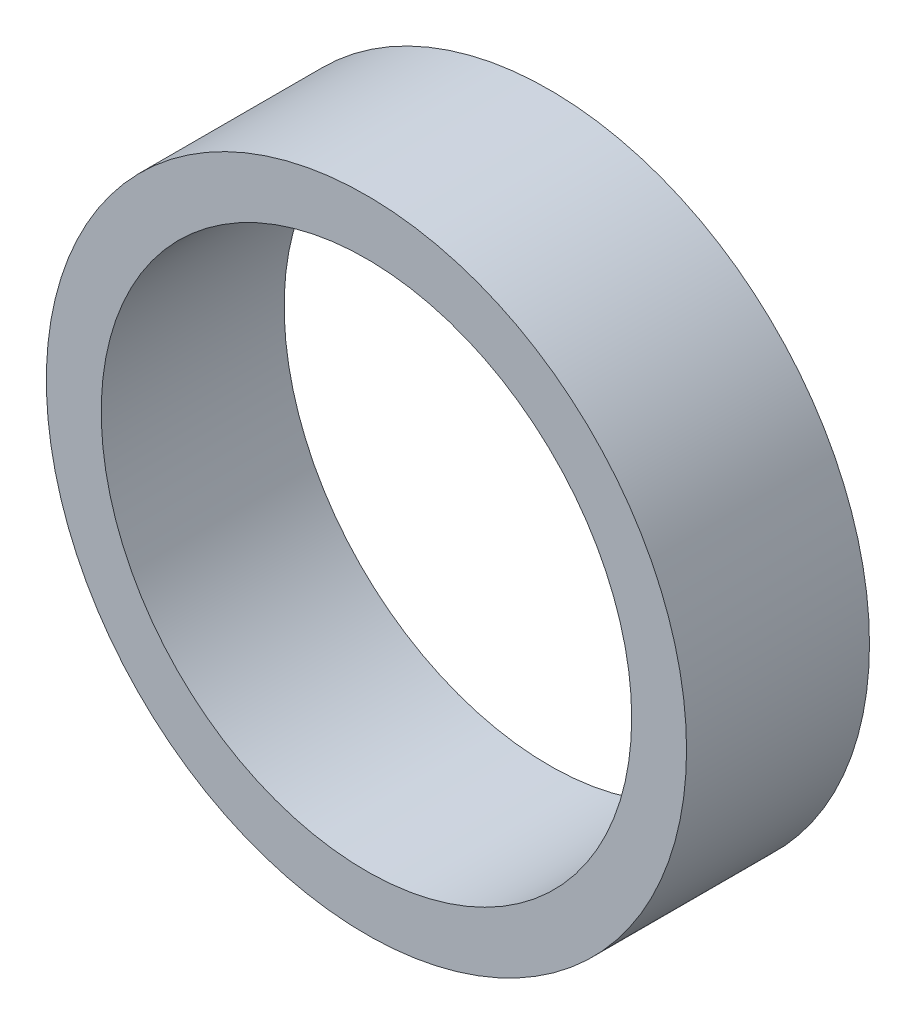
from build123d import *

# Parameters (mm, degrees)
SKETCH1_R        = 44.4499615
SKETCH1_R_2      = 36.83
BASEPIPEXS_DEPTH = 12.7


with BuildPart() as part:
    # Sketch1 → BasePipeXS (new, symmetric)
    with BuildSketch(Plane.XY):
        Circle(SKETCH1_R)
        Circle(SKETCH1_R_2, mode=Mode.SUBTRACT)
    extrude(amount=BASEPIPEXS_DEPTH, both=True)


solid = part.part
